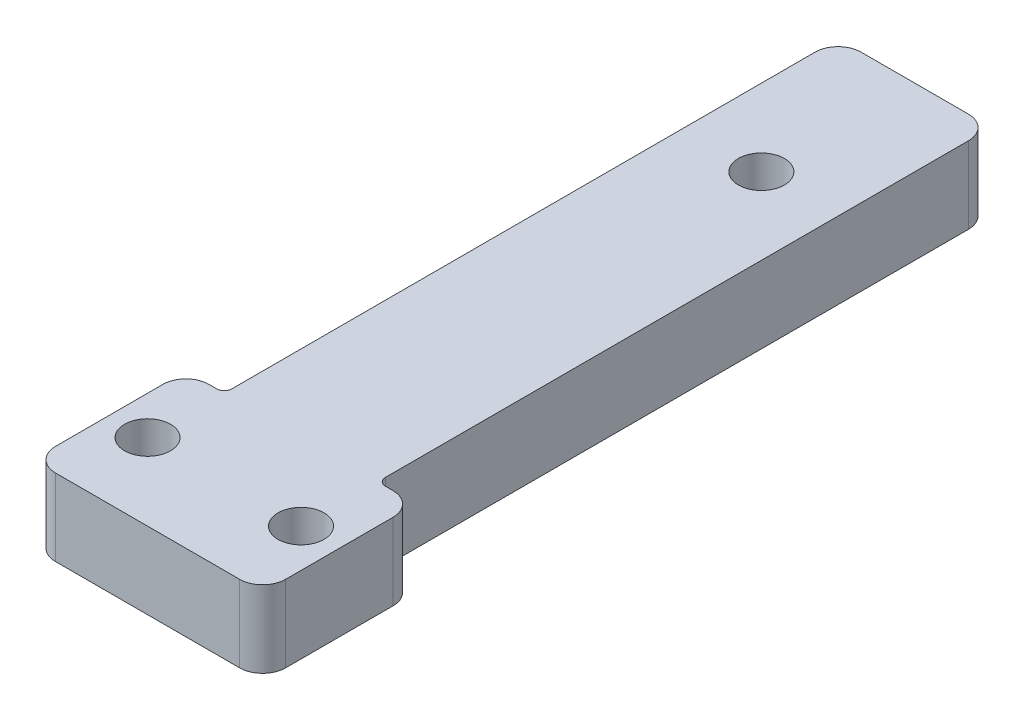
from build123d import *

# Parameters (mm, degrees)
SALIENTE_EXTRUIR1_DEPTH = 10
CROQUIS3_R              = 3
CORTAR_EXTRUIR1_DEPTH   = 10


with BuildPart() as part:
    # Croquis2 → Saliente-Extruir1 (new body)
    with BuildSketch(Plane(origin=(0, 0, 0), x_dir=(1, 0, 0), z_dir=(0, 1, 0))):
        with BuildLine():
            Line((0, 3), (0, 17))
            ThreePointArc((0, 17), (0.878679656, 19.121320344), (3, 20))
            Line((3, 20), (4, 20))
            ThreePointArc((4, 20), (4.707106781, 20.292893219), (5, 21))
            Line((5, 21), (5, 97))
            ThreePointArc((5, 97), (5.878679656, 99.121320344), (8, 100))
            Line((8, 100), (22, 100))
            ThreePointArc((22, 100), (24.121320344, 99.121320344), (25, 97))
            Line((25, 97), (25, 21))
            ThreePointArc((25, 21), (25.292893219, 20.292893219), (26, 20))
            Line((26, 20), (27, 20))
            ThreePointArc((27, 20), (29.121320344, 19.121320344), (30, 17))
            Line((30, 17), (30, 3))
            ThreePointArc((30, 3), (29.121320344, 0.878679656), (27, 0))
            Line((27, 0), (3, 0))
            ThreePointArc((3, 0), (0.878679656, 0.878679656), (0, 3))
        make_face()
    extrude(amount=SALIENTE_EXTRUIR1_DEPTH)

    # Croquis3 → Cortar-Extruir1 (cut)
    with BuildSketch(Plane(origin=(0, 10, 0), x_dir=(1, 0, 0), z_dir=(0, 1, 0))):
        with Locations(Location((5, 10, 0), (0, 0, 270))):
            Circle(CROQUIS3_R)
        with Locations(Location((25, 10, 0), (0, 0, 270))):
            Circle(CROQUIS3_R)
        with Locations(Location((15, 80, 0), (0, 0, 270))):
            Circle(CROQUIS3_R)
    extrude(amount=-CORTAR_EXTRUIR1_DEPTH, mode=Mode.SUBTRACT)


solid = part.part
